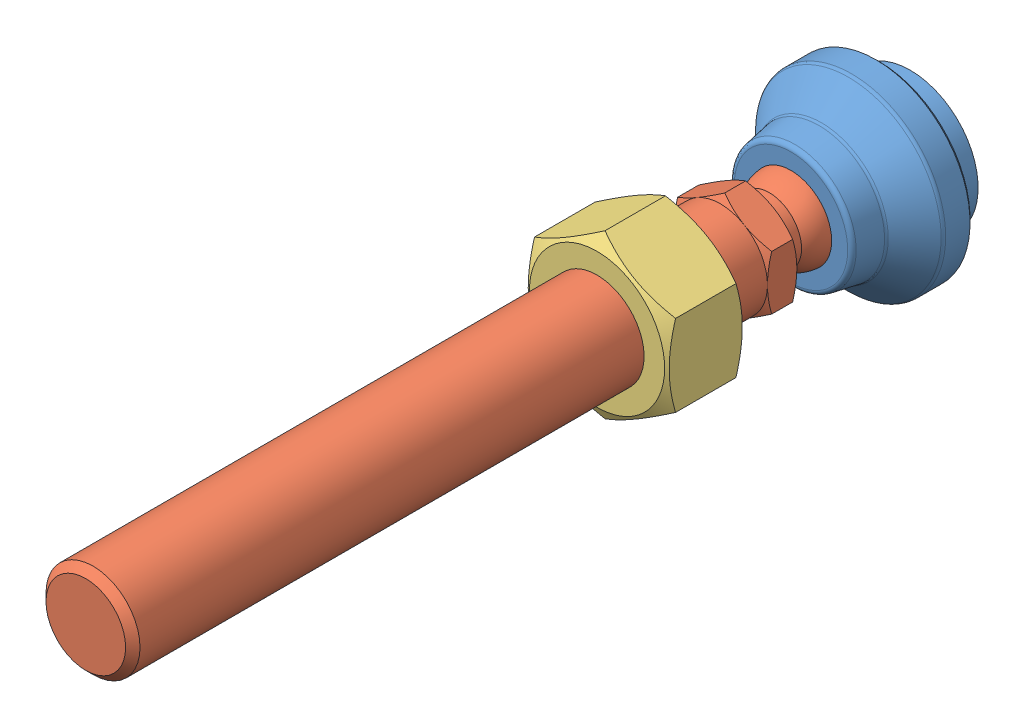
SolidWorks assembly LSVA32-M16X108.sldasm, configuration Default (file format 15000). Lengths in mm.
Overall size (32 32 140.3).
3 component instances, 3 part files, 0 mates.
Components (placement in the parent):
- LSVA32-M16X108_01-1: LSVA32-M16X108_01.SLDPRT [Default] at (0 0 6) x (1 0 0) z (0 -1 0) size (32 20.3 32)
- LSVA32-M16X108_02-1: LSVA32-M16X108_02.sldprt [Default] at (0 0 13.5) x (1 0 0) z (0 -1 0) size (16 127.5 18.48)
- LSVA32-M16X108_03-1: LSVA32-M16X108_03.sldprt [Default] at (0 0 41) size (24 27.71 13)
